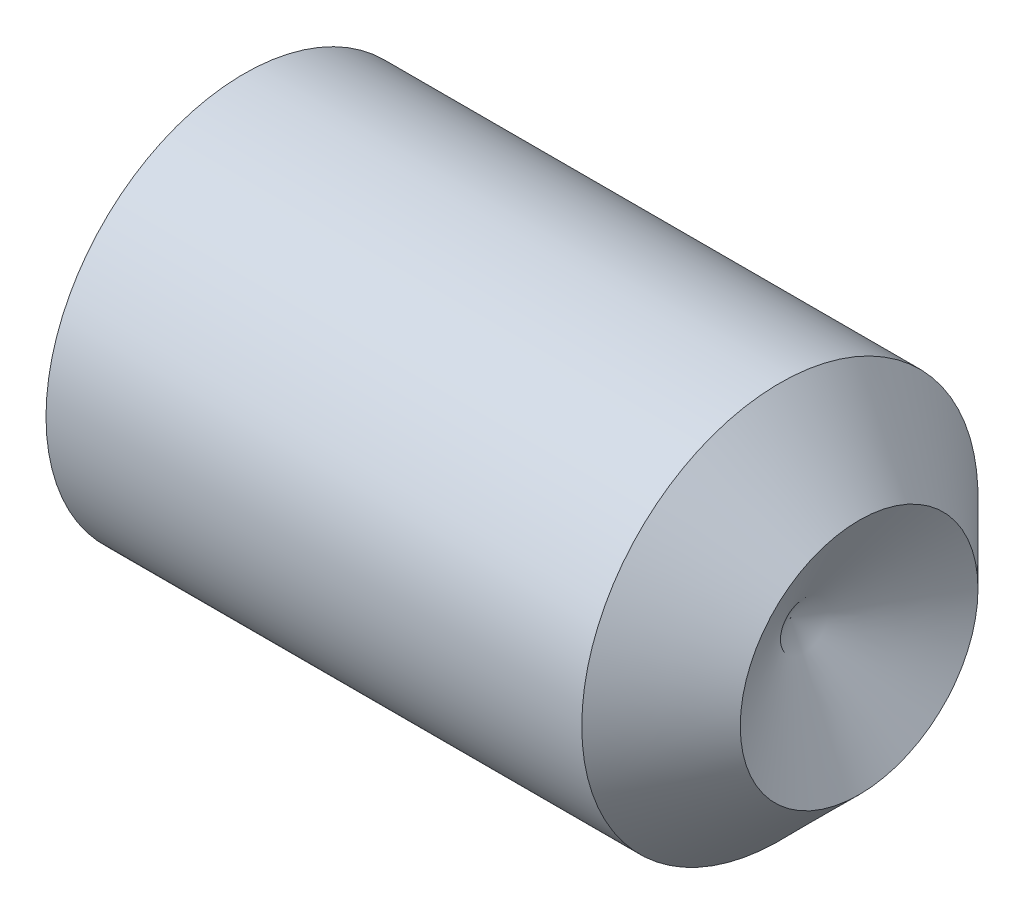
from build123d import *

# Parameters (mm, degrees)
HEX_2_DEPTH = 6


with BuildPart() as part:
    # BodySke → BaseBody (revolve)
    with BuildSketch(Plane.XY, mode=Mode.PRIVATE) as basebody_sk:
        Polygon((0, 0), (0, 4.172), (0.478046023, 5), (14, 5), (16, 3), (14.267949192, 0), align=None)
    revolve(basebody_sk.sketch.rotate(Axis((-12.7, 0, 0), (1, 0, 0)), 90), axis=Axis((-12.7, 0, 0), (1, 0, 0)))

    # Sketch2 → Hex 2 (cut)
    with BuildSketch(Plane.ZY):
        Polygon((1.443375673, 2.5), (-1.443375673, 2.5), (-2.886751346, 0), (-1.443375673, -2.5), (1.443375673, -2.5), (2.886751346, 0), align=None)
    extrude(amount=-HEX_2_DEPTH, mode=Mode.SUBTRACT)


solid = part.part
